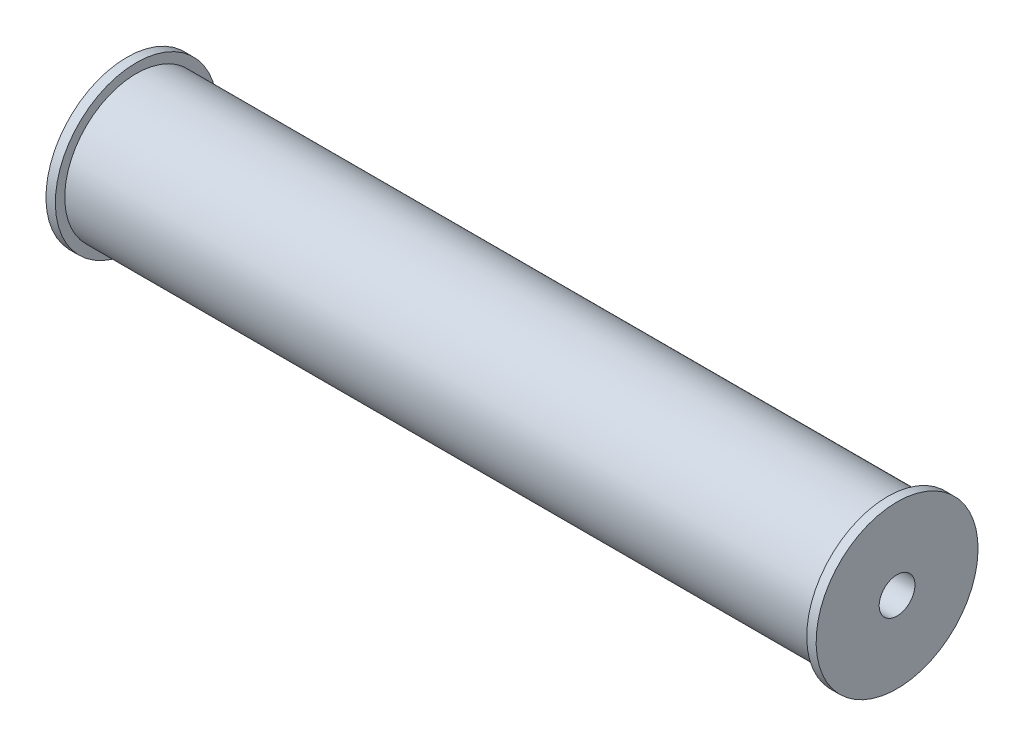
ISO-10303-21;
HEADER;
FILE_DESCRIPTION(('STEP AP214'),'2;1');
FILE_NAME('part.step','',(''),(''),'','','');
FILE_SCHEMA(('AUTOMOTIVE_DESIGN { 1 0 10303 214 1 1 1 1 }'));
ENDSEC;
DATA;
#1=APPLICATION_CONTEXT('core data for automotive mechanical design processes');
#2=APPLICATION_PROTOCOL_DEFINITION('international standard','automotive_design',2000,#1);
#3=PRODUCT_CONTEXT('',#1,'mechanical');
#4=PRODUCT('Part','Part','',(#3));
#5=PRODUCT_RELATED_PRODUCT_CATEGORY('part','',(#4));
#6=PRODUCT_DEFINITION_FORMATION('','',#4);
#7=PRODUCT_DEFINITION_CONTEXT('part definition',#1,'design');
#8=PRODUCT_DEFINITION('design','',#6,#7);
#9=PRODUCT_DEFINITION_SHAPE('','',#8);
#10=(LENGTH_UNIT() NAMED_UNIT(*) SI_UNIT(.MILLI.,.METRE.));
#11=(NAMED_UNIT(*) PLANE_ANGLE_UNIT() SI_UNIT($,.RADIAN.));
#12=(NAMED_UNIT(*) SI_UNIT($,.STERADIAN.) SOLID_ANGLE_UNIT());
#13=UNCERTAINTY_MEASURE_WITH_UNIT(LENGTH_MEASURE(1.E-05),#10,'distance_accuracy_value','');
#14=(GEOMETRIC_REPRESENTATION_CONTEXT(3) GLOBAL_UNCERTAINTY_ASSIGNED_CONTEXT((#13)) GLOBAL_UNIT_ASSIGNED_CONTEXT((#10,
#11,#12)) REPRESENTATION_CONTEXT('',''));
#15=CARTESIAN_POINT('',(0.,0.,0.));
#16=DIRECTION('',(0.,0.,1.));
#17=DIRECTION('',(1.,0.,0.));
#18=AXIS2_PLACEMENT_3D('',#15,#16,#17);
#19=CARTESIAN_POINT('',(3154.61185482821,-173.491801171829,61.0914466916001));
#20=DIRECTION('',(1.,0.,0.));
#21=DIRECTION('',(0.,0.,-1.));
#22=AXIS2_PLACEMENT_3D('',#19,#20,#21);
#23=CYLINDRICAL_SURFACE('',#22,19.05);
#24=CARTESIAN_POINT('',(3357.1118548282,-173.491801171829,61.091446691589));
#25=DIRECTION('',(1.,0.,0.));
#26=DIRECTION('',(0.,1.,0.));
#27=AXIS2_PLACEMENT_3D('',#24,#25,#26);
#28=CIRCLE('',#27,19.05);
#29=CARTESIAN_POINT('',(3357.1118548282,-173.491801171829,42.041446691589));
#30=VERTEX_POINT('',#29);
#31=EDGE_CURVE('E49',#30,#30,#28,.T.);
#32=CARTESIAN_POINT('',(3157.1118548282,-173.491801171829,61.0914466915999));
#33=DIRECTION('',(-1.,0.,0.));
#34=DIRECTION('',(0.,-1.,0.));
#35=AXIS2_PLACEMENT_3D('',#32,#33,#34);
#36=CIRCLE('',#35,19.05);
#37=CARTESIAN_POINT('',(3157.1118548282,-173.491801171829,42.0414466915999));
#38=VERTEX_POINT('',#37);
#39=EDGE_CURVE('E11',#38,#38,#36,.T.);
#40=CARTESIAN_POINT('',(3357.1118548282,-173.491801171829,42.041446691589));
#41=CARTESIAN_POINT('',(3355.02852149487,-173.491801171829,42.0414466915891));
#42=CARTESIAN_POINT('',(3352.94518816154,-173.491801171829,42.0414466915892));
#43=CARTESIAN_POINT('',(3348.77852149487,-173.491801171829,42.0414466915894));
#44=CARTESIAN_POINT('',(3346.69518816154,-173.491801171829,42.0414466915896));
#45=CARTESIAN_POINT('',(3342.52852149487,-173.491801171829,42.0414466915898));
#46=CARTESIAN_POINT('',(3340.44518816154,-173.491801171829,42.0414466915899));
#47=CARTESIAN_POINT('',(3336.27852149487,-173.491801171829,42.0414466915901));
#48=CARTESIAN_POINT('',(3334.19518816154,-173.491801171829,42.0414466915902));
#49=CARTESIAN_POINT('',(3330.02852149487,-173.491801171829,42.0414466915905));
#50=CARTESIAN_POINT('',(3327.94518816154,-173.491801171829,42.0414466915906));
#51=CARTESIAN_POINT('',(3323.77852149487,-173.491801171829,42.0414466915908));
#52=CARTESIAN_POINT('',(3321.69518816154,-173.491801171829,42.0414466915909));
#53=CARTESIAN_POINT('',(3317.52852149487,-173.491801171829,42.0414466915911));
#54=CARTESIAN_POINT('',(3315.44518816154,-173.491801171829,42.0414466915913));
#55=CARTESIAN_POINT('',(3311.27852149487,-173.491801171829,42.0414466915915));
#56=CARTESIAN_POINT('',(3309.19518816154,-173.491801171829,42.0414466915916));
#57=CARTESIAN_POINT('',(3305.02852149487,-173.491801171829,42.0414466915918));
#58=CARTESIAN_POINT('',(3302.94518816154,-173.491801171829,42.0414466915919));
#59=CARTESIAN_POINT('',(3298.77852149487,-173.491801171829,42.0414466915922));
#60=CARTESIAN_POINT('',(3296.69518816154,-173.491801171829,42.0414466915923));
#61=CARTESIAN_POINT('',(3292.52852149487,-173.491801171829,42.0414466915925));
#62=CARTESIAN_POINT('',(3290.44518816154,-173.491801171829,42.0414466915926));
#63=CARTESIAN_POINT('',(3286.27852149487,-173.491801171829,42.0414466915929));
#64=CARTESIAN_POINT('',(3284.19518816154,-173.491801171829,42.041446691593));
#65=CARTESIAN_POINT('',(3280.02852149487,-173.491801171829,42.0414466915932));
#66=CARTESIAN_POINT('',(3277.94518816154,-173.491801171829,42.0414466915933));
#67=CARTESIAN_POINT('',(3273.77852149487,-173.491801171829,42.0414466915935));
#68=CARTESIAN_POINT('',(3271.69518816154,-173.491801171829,42.0414466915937));
#69=CARTESIAN_POINT('',(3267.52852149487,-173.491801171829,42.0414466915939));
#70=CARTESIAN_POINT('',(3265.44518816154,-173.491801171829,42.041446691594));
#71=CARTESIAN_POINT('',(3261.27852149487,-173.491801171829,42.0414466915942));
#72=CARTESIAN_POINT('',(3259.19518816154,-173.491801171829,42.0414466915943));
#73=CARTESIAN_POINT('',(3255.02852149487,-173.491801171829,42.0414466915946));
#74=CARTESIAN_POINT('',(3252.94518816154,-173.491801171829,42.0414466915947));
#75=CARTESIAN_POINT('',(3248.77852149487,-173.491801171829,42.0414466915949));
#76=CARTESIAN_POINT('',(3246.69518816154,-173.491801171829,42.041446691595));
#77=CARTESIAN_POINT('',(3242.52852149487,-173.491801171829,42.0414466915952));
#78=CARTESIAN_POINT('',(3240.44518816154,-173.491801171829,42.0414466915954));
#79=CARTESIAN_POINT('',(3236.27852149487,-173.491801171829,42.0414466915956));
#80=CARTESIAN_POINT('',(3234.19518816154,-173.491801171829,42.0414466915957));
#81=CARTESIAN_POINT('',(3230.02852149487,-173.491801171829,42.0414466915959));
#82=CARTESIAN_POINT('',(3227.94518816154,-173.491801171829,42.0414466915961));
#83=CARTESIAN_POINT('',(3223.77852149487,-173.491801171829,42.0414466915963));
#84=CARTESIAN_POINT('',(3221.69518816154,-173.491801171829,42.0414466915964));
#85=CARTESIAN_POINT('',(3217.52852149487,-173.491801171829,42.0414466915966));
#86=CARTESIAN_POINT('',(3215.44518816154,-173.491801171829,42.0414466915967));
#87=CARTESIAN_POINT('',(3211.27852149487,-173.491801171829,42.041446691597));
#88=CARTESIAN_POINT('',(3209.19518816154,-173.491801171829,42.0414466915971));
#89=CARTESIAN_POINT('',(3205.02852149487,-173.491801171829,42.0414466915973));
#90=CARTESIAN_POINT('',(3202.94518816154,-173.491801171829,42.0414466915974));
#91=CARTESIAN_POINT('',(3198.77852149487,-173.491801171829,42.0414466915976));
#92=CARTESIAN_POINT('',(3196.69518816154,-173.491801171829,42.0414466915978));
#93=CARTESIAN_POINT('',(3192.52852149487,-173.491801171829,42.041446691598));
#94=CARTESIAN_POINT('',(3190.44518816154,-173.491801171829,42.0414466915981));
#95=CARTESIAN_POINT('',(3186.27852149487,-173.491801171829,42.0414466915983));
#96=CARTESIAN_POINT('',(3184.19518816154,-173.491801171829,42.0414466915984));
#97=CARTESIAN_POINT('',(3180.02852149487,-173.491801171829,42.0414466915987));
#98=CARTESIAN_POINT('',(3177.94518816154,-173.491801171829,42.0414466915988));
#99=CARTESIAN_POINT('',(3173.77852149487,-173.491801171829,42.041446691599));
#100=CARTESIAN_POINT('',(3171.69518816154,-173.491801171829,42.0414466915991));
#101=CARTESIAN_POINT('',(3167.52852149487,-173.491801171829,42.0414466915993));
#102=CARTESIAN_POINT('',(3165.44518816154,-173.491801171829,42.0414466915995));
#103=CARTESIAN_POINT('',(3161.27852149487,-173.491801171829,42.0414466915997));
#104=CARTESIAN_POINT('',(3159.19518816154,-173.491801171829,42.0414466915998));
#105=CARTESIAN_POINT('',(3157.1118548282,-173.491801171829,42.0414466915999));
#106=B_SPLINE_CURVE_WITH_KNOTS('',3,(#40,#41,#42,#43,#44,#45,#46,#47,#48,#49,#50,#51,#52,#53,
#54,#55,#56,#57,#58,#59,#60,#61,#62,#63,#64,#65,#66,#67,#68,#69,#70,#71,#72,#73,#74,#75,#76,#77,
#78,#79,#80,#81,#82,#83,#84,#85,#86,#87,#88,#89,#90,#91,#92,#93,#94,#95,#96,#97,#98,#99,#100,
#101,#102,#103,#104,#105),.UNSPECIFIED.,.F.,.F.,(4,2,2,2,2,2,2,2,2,2,2,2,2,2,2,2,2,2,2,2,2,2,2,
2,2,2,2,2,2,2,2,2,4),(0.,6.25000000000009,12.5000000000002,18.7500000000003,25.0000000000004,
31.2500000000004,37.5000000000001,43.7500000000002,50.0000000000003,56.2500000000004,
62.5000000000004,68.7500000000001,75.0000000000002,81.2500000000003,87.5000000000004,
93.7500000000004,100.,106.25,112.5,118.75,125.,131.250000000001,137.5,143.75,150.,156.25,
162.500000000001,168.75,175.,181.25,187.5,193.750000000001,200.000000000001),.UNSPECIFIED.);
#107=EDGE_CURVE('BSEAM43',#30,#38,#106,.T.);
#108=ORIENTED_EDGE('',*,*,#31,.F.);
#109=ORIENTED_EDGE('',*,*,#39,.F.);
#110=ORIENTED_EDGE('',*,*,#107,.T.);
#111=ORIENTED_EDGE('',*,*,#107,.F.);
#112=EDGE_LOOP('',(#108,#110,#109,#111));
#113=FACE_BOUND('',#112,.T.);
#114=ADVANCED_FACE('F43',(#113),#23,.T.);
#115=CARTESIAN_POINT('',(3154.61185482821,-173.491801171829,61.0914466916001));
#116=DIRECTION('',(-1.,0.,0.));
#117=DIRECTION('',(0.,0.,1.));
#118=AXIS2_PLACEMENT_3D('',#115,#116,#117);
#119=PLANE('',#118);
#120=CARTESIAN_POINT('',(3154.61185482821,-173.491801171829,61.0914466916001));
#121=DIRECTION('',(-1.,0.,0.));
#122=DIRECTION('',(0.,0.,1.));
#123=AXIS2_PLACEMENT_3D('',#120,#121,#122);
#124=CIRCLE('',#123,4.76250000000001);
#125=CARTESIAN_POINT('',(3154.61185482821,-173.491801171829,56.3289466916));
#126=VERTEX_POINT('',#125);
#127=EDGE_CURVE('E53',#126,#126,#124,.T.);
#128=ORIENTED_EDGE('',*,*,#127,.F.);
#129=EDGE_LOOP('',(#128));
#130=FACE_BOUND('',#129,.T.);
#131=CARTESIAN_POINT('',(3154.6118548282,-173.491801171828,61.0914466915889));
#132=DIRECTION('',(1.,0.,0.));
#133=DIRECTION('',(0.,1.,0.));
#134=AXIS2_PLACEMENT_3D('',#131,#132,#133);
#135=CIRCLE('',#134,21.5499999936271);
#136=CARTESIAN_POINT('',(3154.6118548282,-151.941801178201,61.0914466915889));
#137=VERTEX_POINT('',#136);
#138=EDGE_CURVE('E69',#137,#137,#135,.T.);
#139=ORIENTED_EDGE('',*,*,#138,.F.);
#140=EDGE_LOOP('',(#139));
#141=FACE_BOUND('',#140,.T.);
#142=ADVANCED_FACE('F83',(#130,#141),#119,.T.);
#143=CARTESIAN_POINT('',(3359.61185482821,-173.491801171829,61.0914466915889));
#144=DIRECTION('',(-1.,0.,0.));
#145=DIRECTION('',(0.,0.,1.));
#146=AXIS2_PLACEMENT_3D('',#143,#144,#145);
#147=PLANE('',#146);
#148=CARTESIAN_POINT('',(3359.61185482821,-173.491801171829,61.0914466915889));
#149=DIRECTION('',(-1.,0.,0.));
#150=DIRECTION('',(0.,0.,1.));
#151=AXIS2_PLACEMENT_3D('',#148,#149,#150);
#152=CIRCLE('',#151,4.76250000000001);
#153=CARTESIAN_POINT('',(3359.61185482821,-173.491801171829,56.3289466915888));
#154=VERTEX_POINT('',#153);
#155=EDGE_CURVE('E57',#154,#154,#152,.T.);
#156=ORIENTED_EDGE('',*,*,#155,.T.);
#157=EDGE_LOOP('',(#156));
#158=FACE_BOUND('',#157,.T.);
#159=CARTESIAN_POINT('',(3359.6118548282,-173.491801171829,61.0914466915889));
#160=DIRECTION('',(1.,0.,0.));
#161=DIRECTION('',(0.,1.,0.));
#162=AXIS2_PLACEMENT_3D('',#159,#160,#161);
#163=CIRCLE('',#162,21.5499999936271);
#164=CARTESIAN_POINT('',(3359.6118548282,-151.941801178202,61.0914466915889));
#165=VERTEX_POINT('',#164);
#166=EDGE_CURVE('E63',#165,#165,#163,.T.);
#167=ORIENTED_EDGE('',*,*,#166,.T.);
#168=EDGE_LOOP('',(#167));
#169=FACE_BOUND('',#168,.T.);
#170=ADVANCED_FACE('F85',(#158,#169),#147,.F.);
#171=CARTESIAN_POINT('',(3154.61185482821,-173.491801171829,61.0914466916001));
#172=DIRECTION('',(1.,0.,0.));
#173=DIRECTION('',(0.,0.,-1.));
#174=AXIS2_PLACEMENT_3D('',#171,#172,#173);
#175=CYLINDRICAL_SURFACE('',#174,4.76250000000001);
#176=CARTESIAN_POINT('',(3154.61185482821,-173.491801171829,56.3289466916));
#177=CARTESIAN_POINT('',(3156.74727149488,-173.491801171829,56.3289466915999));
#178=CARTESIAN_POINT('',(3158.88268816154,-173.491801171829,56.3289466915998));
#179=CARTESIAN_POINT('',(3163.15352149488,-173.491801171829,56.3289466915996));
#180=CARTESIAN_POINT('',(3165.28893816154,-173.491801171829,56.3289466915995));
#181=CARTESIAN_POINT('',(3169.55977149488,-173.491801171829,56.3289466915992));
#182=CARTESIAN_POINT('',(3171.69518816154,-173.491801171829,56.3289466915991));
#183=CARTESIAN_POINT('',(3175.96602149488,-173.491801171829,56.3289466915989));
#184=CARTESIAN_POINT('',(3178.10143816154,-173.491801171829,56.3289466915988));
#185=CARTESIAN_POINT('',(3182.37227149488,-173.491801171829,56.3289466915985));
#186=CARTESIAN_POINT('',(3184.50768816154,-173.491801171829,56.3289466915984));
#187=CARTESIAN_POINT('',(3188.77852149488,-173.491801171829,56.3289466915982));
#188=CARTESIAN_POINT('',(3190.91393816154,-173.491801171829,56.3289466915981));
#189=CARTESIAN_POINT('',(3195.18477149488,-173.491801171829,56.3289466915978));
#190=CARTESIAN_POINT('',(3197.32018816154,-173.491801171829,56.3289466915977));
#191=CARTESIAN_POINT('',(3201.59102149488,-173.491801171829,56.3289466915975));
#192=CARTESIAN_POINT('',(3203.72643816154,-173.491801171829,56.3289466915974));
#193=CARTESIAN_POINT('',(3207.99727149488,-173.491801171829,56.3289466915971));
#194=CARTESIAN_POINT('',(3210.13268816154,-173.491801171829,56.328946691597));
#195=CARTESIAN_POINT('',(3214.40352149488,-173.491801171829,56.3289466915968));
#196=CARTESIAN_POINT('',(3216.53893816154,-173.491801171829,56.3289466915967));
#197=CARTESIAN_POINT('',(3220.80977149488,-173.491801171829,56.3289466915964));
#198=CARTESIAN_POINT('',(3222.94518816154,-173.491801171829,56.3289466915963));
#199=CARTESIAN_POINT('',(3227.21602149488,-173.491801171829,56.3289466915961));
#200=CARTESIAN_POINT('',(3229.35143816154,-173.491801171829,56.328946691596));
#201=CARTESIAN_POINT('',(3233.62227149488,-173.491801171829,56.3289466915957));
#202=CARTESIAN_POINT('',(3235.75768816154,-173.491801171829,56.3289466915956));
#203=CARTESIAN_POINT('',(3240.02852149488,-173.491801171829,56.3289466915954));
#204=CARTESIAN_POINT('',(3242.16393816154,-173.491801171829,56.3289466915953));
#205=CARTESIAN_POINT('',(3246.43477149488,-173.491801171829,56.328946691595));
#206=CARTESIAN_POINT('',(3248.57018816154,-173.491801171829,56.3289466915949));
#207=CARTESIAN_POINT('',(3252.84102149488,-173.491801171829,56.3289466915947));
#208=CARTESIAN_POINT('',(3254.97643816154,-173.491801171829,56.3289466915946));
#209=CARTESIAN_POINT('',(3259.24727149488,-173.491801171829,56.3289466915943));
#210=CARTESIAN_POINT('',(3261.38268816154,-173.491801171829,56.3289466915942));
#211=CARTESIAN_POINT('',(3265.65352149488,-173.491801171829,56.328946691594));
#212=CARTESIAN_POINT('',(3267.78893816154,-173.491801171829,56.3289466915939));
#213=CARTESIAN_POINT('',(3272.05977149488,-173.491801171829,56.3289466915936));
#214=CARTESIAN_POINT('',(3274.19518816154,-173.491801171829,56.3289466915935));
#215=CARTESIAN_POINT('',(3278.46602149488,-173.491801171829,56.3289466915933));
#216=CARTESIAN_POINT('',(3280.60143816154,-173.491801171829,56.3289466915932));
#217=CARTESIAN_POINT('',(3284.87227149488,-173.491801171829,56.3289466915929));
#218=CARTESIAN_POINT('',(3287.00768816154,-173.491801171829,56.3289466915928));
#219=CARTESIAN_POINT('',(3291.27852149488,-173.491801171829,56.3289466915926));
#220=CARTESIAN_POINT('',(3293.41393816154,-173.491801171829,56.3289466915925));
#221=CARTESIAN_POINT('',(3297.68477149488,-173.491801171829,56.3289466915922));
#222=CARTESIAN_POINT('',(3299.82018816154,-173.491801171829,56.3289466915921));
#223=CARTESIAN_POINT('',(3304.09102149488,-173.491801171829,56.3289466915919));
#224=CARTESIAN_POINT('',(3306.22643816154,-173.491801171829,56.3289466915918));
#225=CARTESIAN_POINT('',(3310.49727149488,-173.491801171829,56.3289466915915));
#226=CARTESIAN_POINT('',(3312.63268816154,-173.491801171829,56.3289466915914));
#227=CARTESIAN_POINT('',(3316.90352149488,-173.491801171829,56.3289466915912));
#228=CARTESIAN_POINT('',(3319.03893816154,-173.491801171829,56.3289466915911));
#229=CARTESIAN_POINT('',(3323.30977149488,-173.491801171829,56.3289466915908));
#230=CARTESIAN_POINT('',(3325.44518816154,-173.491801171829,56.3289466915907));
#231=CARTESIAN_POINT('',(3329.71602149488,-173.491801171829,56.3289466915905));
#232=CARTESIAN_POINT('',(3331.85143816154,-173.491801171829,56.3289466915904));
#233=CARTESIAN_POINT('',(3336.12227149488,-173.491801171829,56.3289466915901));
#234=CARTESIAN_POINT('',(3338.25768816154,-173.491801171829,56.32894669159));
#235=CARTESIAN_POINT('',(3342.52852149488,-173.491801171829,56.3289466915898));
#236=CARTESIAN_POINT('',(3344.66393816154,-173.491801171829,56.3289466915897));
#237=CARTESIAN_POINT('',(3348.93477149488,-173.491801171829,56.3289466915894));
#238=CARTESIAN_POINT('',(3351.07018816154,-173.491801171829,56.3289466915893));
#239=CARTESIAN_POINT('',(3355.34102149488,-173.491801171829,56.3289466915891));
#240=CARTESIAN_POINT('',(3357.47643816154,-173.491801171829,56.328946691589));
#241=CARTESIAN_POINT('',(3359.61185482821,-173.491801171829,56.3289466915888));
#242=B_SPLINE_CURVE_WITH_KNOTS('',3,(#176,#177,#178,#179,#180,#181,#182,#183,#184,#185,#186,
#187,#188,#189,#190,#191,#192,#193,#194,#195,#196,#197,#198,#199,#200,#201,#202,#203,#204,#205,
#206,#207,#208,#209,#210,#211,#212,#213,#214,#215,#216,#217,#218,#219,#220,#221,#222,#223,#224,
#225,#226,#227,#228,#229,#230,#231,#232,#233,#234,#235,#236,#237,#238,#239,#240,#241),
.UNSPECIFIED.,.F.,.F.,(4,2,2,2,2,2,2,2,2,2,2,2,2,2,2,2,2,2,2,2,2,2,2,2,2,2,2,2,2,2,2,2,4),(0.,
6.40625000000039,12.8125000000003,19.2187500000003,25.6250000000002,32.0312500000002,
38.4375000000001,44.8437500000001,51.25,57.6562500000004,64.0625000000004,70.4687500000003,
76.8750000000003,83.2812500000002,89.6875000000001,96.0937500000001,102.5,108.90625,115.3125,
121.71875,128.125,134.53125,140.9375,147.34375,153.75,160.15625,166.5625,172.96875,179.375,
185.78125,192.1875,198.59375,205.),.UNSPECIFIED.);
#243=EDGE_CURVE('BSEAM93',#126,#154,#242,.T.);
#244=ORIENTED_EDGE('',*,*,#127,.T.);
#245=ORIENTED_EDGE('',*,*,#155,.F.);
#246=ORIENTED_EDGE('',*,*,#243,.T.);
#247=ORIENTED_EDGE('',*,*,#243,.F.);
#248=EDGE_LOOP('',(#244,#246,#245,#247));
#249=FACE_BOUND('',#248,.T.);
#250=ADVANCED_FACE('F93',(#249),#175,.F.);
#251=CARTESIAN_POINT('',(3357.1118548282,-173.491801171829,61.0914466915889));
#252=DIRECTION('',(1.,0.,0.));
#253=DIRECTION('',(0.,1.,0.));
#254=AXIS2_PLACEMENT_3D('',#251,#252,#253);
#255=CYLINDRICAL_SURFACE('',#254,21.5499999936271);
#256=CARTESIAN_POINT('',(3357.1118548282,-173.491801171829,61.0914466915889));
#257=DIRECTION('',(1.,0.,0.));
#258=DIRECTION('',(0.,1.,0.));
#259=AXIS2_PLACEMENT_3D('',#256,#257,#258);
#260=CIRCLE('',#259,21.5499999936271);
#261=CARTESIAN_POINT('',(3357.1118548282,-151.941801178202,61.0914466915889));
#262=VERTEX_POINT('',#261);
#263=EDGE_CURVE('E61',#262,#262,#260,.T.);
#264=ORIENTED_EDGE('',*,*,#263,.T.);
#265=EDGE_LOOP('',(#264));
#266=FACE_BOUND('',#265,.T.);
#267=ORIENTED_EDGE('',*,*,#166,.F.);
#268=EDGE_LOOP('',(#267));
#269=FACE_BOUND('',#268,.T.);
#270=ADVANCED_FACE('F100',(#266,#269),#255,.T.);
#271=CARTESIAN_POINT('',(3357.1118548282,-173.491801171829,61.0914466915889));
#272=DIRECTION('',(1.,0.,0.));
#273=DIRECTION('',(0.,1.,0.));
#274=AXIS2_PLACEMENT_3D('',#271,#272,#273);
#275=PLANE('',#274);
#276=ORIENTED_EDGE('',*,*,#31,.T.);
#277=EDGE_LOOP('',(#276));
#278=FACE_BOUND('',#277,.T.);
#279=ORIENTED_EDGE('',*,*,#263,.F.);
#280=EDGE_LOOP('',(#279));
#281=FACE_BOUND('',#280,.T.);
#282=ADVANCED_FACE('F104',(#278,#281),#275,.F.);
#283=CARTESIAN_POINT('',(3157.1118548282,-173.491801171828,61.0914466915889));
#284=DIRECTION('',(-1.,0.,0.));
#285=DIRECTION('',(0.,1.,0.));
#286=AXIS2_PLACEMENT_3D('',#283,#284,#285);
#287=PLANE('',#286);
#288=CARTESIAN_POINT('',(3157.1118548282,-173.491801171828,61.0914466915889));
#289=DIRECTION('',(1.,0.,0.));
#290=DIRECTION('',(0.,1.,0.));
#291=AXIS2_PLACEMENT_3D('',#288,#289,#290);
#292=CIRCLE('',#291,21.5499999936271);
#293=CARTESIAN_POINT('',(3157.1118548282,-151.941801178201,61.0914466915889));
#294=VERTEX_POINT('',#293);
#295=EDGE_CURVE('E66',#294,#294,#292,.T.);
#296=ORIENTED_EDGE('',*,*,#295,.T.);
#297=EDGE_LOOP('',(#296));
#298=FACE_BOUND('',#297,.T.);
#299=ORIENTED_EDGE('',*,*,#39,.T.);
#300=EDGE_LOOP('',(#299));
#301=FACE_BOUND('',#300,.T.);
#302=ADVANCED_FACE('F75',(#298,#301),#287,.F.);
#303=CARTESIAN_POINT('',(3157.1118548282,-173.491801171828,61.0914466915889));
#304=DIRECTION('',(-1.,0.,0.));
#305=DIRECTION('',(0.,-1.,0.));
#306=AXIS2_PLACEMENT_3D('',#303,#304,#305);
#307=CYLINDRICAL_SURFACE('',#306,21.5499999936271);
#308=ORIENTED_EDGE('',*,*,#295,.F.);
#309=EDGE_LOOP('',(#308));
#310=FACE_BOUND('',#309,.T.);
#311=ORIENTED_EDGE('',*,*,#138,.T.);
#312=EDGE_LOOP('',(#311));
#313=FACE_BOUND('',#312,.T.);
#314=ADVANCED_FACE('F77',(#310,#313),#307,.T.);
#315=CLOSED_SHELL('',(#114,#142,#170,#250,#270,#282,#302,#314));
#316=MANIFOLD_SOLID_BREP('B2',#315);
#317=ADVANCED_BREP_SHAPE_REPRESENTATION('',(#18,#316),#14);
#318=SHAPE_DEFINITION_REPRESENTATION(#9,#317);
ENDSEC;
END-ISO-10303-21;
